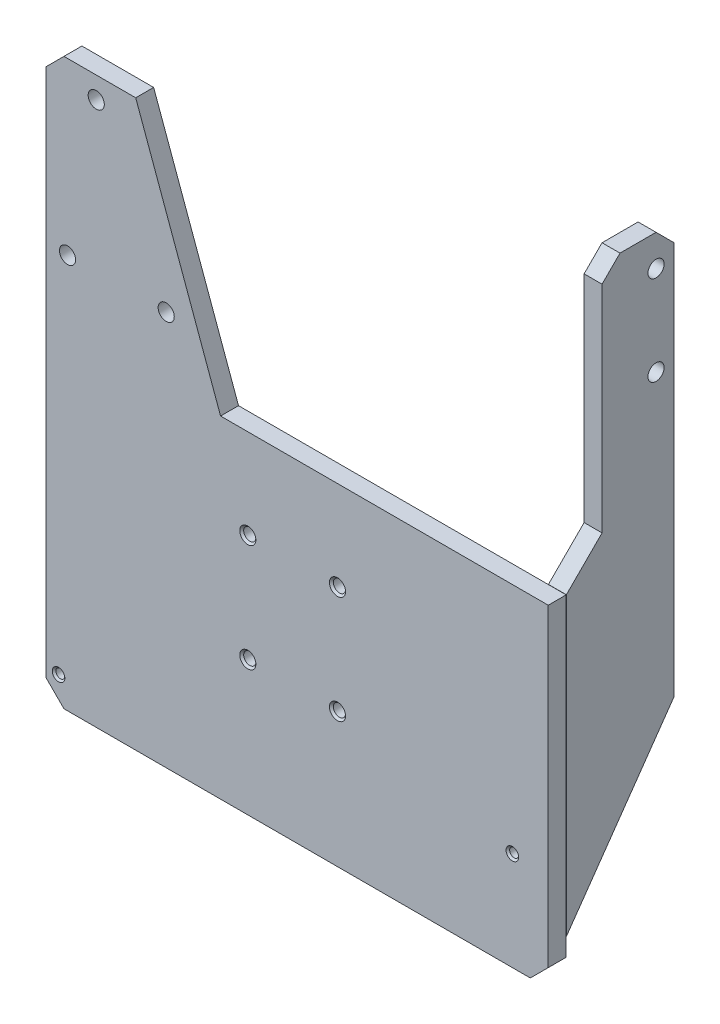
from build123d import *

# Parameters (mm, degrees)
EXTRUSION2_DEPTH           = 10
CHANFREIN2_SIZE            = 10
ESQUISSE4_R                = 4.5
ENL_V_MAT_EXTRU_1_DEPTH    = 307.634962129
EXTRUSION3_DEPTH           = 10
ESQUISSE8_R                = 4.5
ENL_V_MAT_EXTRU_3_DEPTH    = 408.568411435
TROU_TARAUD_M61_AT_2_COUNT = 2
TROU_TARAUD_M61_AT_2_PITCH = 256.142538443
TROU_TARAUD_M81_AT_2_COUNT = 2
TROU_TARAUD_M81_AT_2_PITCH = 50
TROU_TARAUD_M81_AT_3_COUNT = 2
TROU_TARAUD_M81_AT_3_PITCH = 60
TROU_TARAUD_M81_AT_4_COUNT = 2
TROU_TARAUD_M81_AT_4_PITCH = 78.102496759


with BuildPart() as part:
    # Esquisse3 → Extrusion2 (new body)
    with BuildSketch(Plane.XY):
        Polygon((135, -45), (-145, -45), (-145, 270), (-95, 270), (-47.683869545, 140), (135, 140), align=None)
    extrude(amount=EXTRUSION2_DEPTH)

    # Chanfrein2
    chanfrein2_edges = [part.edges().sort_by_distance(p)[0] for p in [
        (-145, 270, 5),
        (135, -45, 5),
        (-145, -45, 5),
    ]]
    chamfer(chanfrein2_edges, length=CHANFREIN2_SIZE)

    # Esquisse4 → Enl_v. mat.-Extru.1 (cut, through all)
    with BuildSketch(Plane.XY.offset(10)):
        with Locations((-117, 258)):
            Circle(ESQUISSE4_R)
        with Locations((-133, 175)):
            Circle(ESQUISSE4_R)
        with Locations((-78, 175)):
            Circle(ESQUISSE4_R)
    extrude(amount=-ENL_V_MAT_EXTRU_1_DEPTH, mode=Mode.SUBTRACT)

    # Esquisse9 → Trou taraud_ M61 (revolve, cut)
    with BuildSketch(Plane(origin=(-138, -30, 10), x_dir=(0, -1, 0), z_dir=(1, 0, 0))):
        Polygon((0, 0), (0, 70.1), (2.5, 70.1), (2.5, 1), (3.5, 0), align=None)
    trou_taraud_m61 = revolve(axis=Axis((-138, -30, 16.35), (0, 0, -1)), mode=Mode.SUBTRACT)

    # Trou taraud_ M61 at 2: Trou taraud_ M61 ×2
    with Locations(*[Vector(0.9877312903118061, 0.15616304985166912, 0) * (i * TROU_TARAUD_M61_AT_2_PITCH) for i in range(1, TROU_TARAUD_M61_AT_2_COUNT)]):
        add(trou_taraud_m61, mode=Mode.SUBTRACT)

    # Esquisse10 → Trou taraud_ M81 (revolve, cut)
    with BuildSketch(Plane(origin=(-32.5, 90, 10), x_dir=(0, -1, 0), z_dir=(1, 0, 0))):
        Polygon((0, 0), (0, 70.1), (3.4, 70.1), (3.4, 1.1), (4.5, 0), align=None)
    trou_taraud_m81 = revolve(axis=Axis((-32.5, 90, 16.35), (0, 0, -1)), mode=Mode.SUBTRACT)

    # Trou taraud_ M81 at 2: Trou taraud_ M81 ×2
    with Locations(*[(i * TROU_TARAUD_M81_AT_2_PITCH, 0, 0) for i in range(1, TROU_TARAUD_M81_AT_2_COUNT)]):
        add(trou_taraud_m81, mode=Mode.SUBTRACT)

    # Trou taraud_ M81 at 3: Trou taraud_ M81 ×2
    with Locations(*[(0, -i * TROU_TARAUD_M81_AT_3_PITCH, 0) for i in range(1, TROU_TARAUD_M81_AT_3_COUNT)]):
        add(trou_taraud_m81, mode=Mode.SUBTRACT)

    # Trou taraud_ M81 at 4: Trou taraud_ M81 ×2
    with Locations(*[Vector(0.6401843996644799, -0.7682212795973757, 0) * (i * TROU_TARAUD_M81_AT_4_PITCH) for i in range(1, TROU_TARAUD_M81_AT_4_COUNT)]):
        add(trou_taraud_m81, mode=Mode.SUBTRACT)


with BuildPart() as body_2:
    # Esquisse7 → Extrusion3 (new body)
    with BuildSketch(Plane(origin=(135, 0, 0), x_dir=(0, 0, -1), z_dir=(1, 0, 0))):
        Polygon((30, 290), (50.1, 290), (60.1, 280), (60.1, 60.688880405), (0.1, -25), (0.1, 140), (20, 159.9), (20, 280), align=None)
    extrude(amount=-EXTRUSION3_DEPTH)

    # Esquisse8 → Enl_v. mat.-Extru.3 (cut, through all)
    with BuildSketch(Plane(origin=(135, 0, 0), x_dir=(0, 0, -1), z_dir=(1, 0, 0))):
        with Locations((50.1, 272.5)):
            Circle(ESQUISSE8_R)
        with Locations((50.1, 222.5)):
            Circle(ESQUISSE8_R)
    extrude(amount=-ENL_V_MAT_EXTRU_3_DEPTH, mode=Mode.SUBTRACT)


solid = Compound([part.part, body_2.part])
